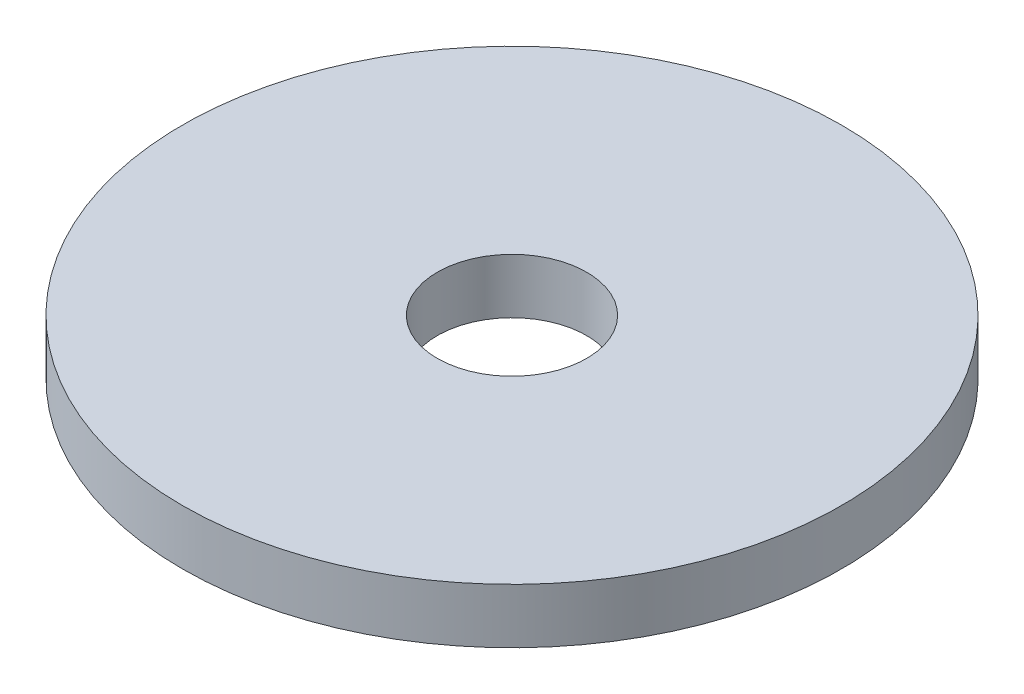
ISO-10303-21;
HEADER;
FILE_DESCRIPTION(('STEP AP214'),'2;1');
FILE_NAME('part.step','',(''),(''),'','','');
FILE_SCHEMA(('AUTOMOTIVE_DESIGN { 1 0 10303 214 1 1 1 1 }'));
ENDSEC;
DATA;
#1=APPLICATION_CONTEXT('core data for automotive mechanical design processes');
#2=APPLICATION_PROTOCOL_DEFINITION('international standard','automotive_design',2000,#1);
#3=PRODUCT_CONTEXT('',#1,'mechanical');
#4=PRODUCT('Part','Part','',(#3));
#5=PRODUCT_RELATED_PRODUCT_CATEGORY('part','',(#4));
#6=PRODUCT_DEFINITION_FORMATION('','',#4);
#7=PRODUCT_DEFINITION_CONTEXT('part definition',#1,'design');
#8=PRODUCT_DEFINITION('design','',#6,#7);
#9=PRODUCT_DEFINITION_SHAPE('','',#8);
#10=(LENGTH_UNIT() NAMED_UNIT(*) SI_UNIT(.MILLI.,.METRE.));
#11=(NAMED_UNIT(*) PLANE_ANGLE_UNIT() SI_UNIT($,.RADIAN.));
#12=(NAMED_UNIT(*) SI_UNIT($,.STERADIAN.) SOLID_ANGLE_UNIT());
#13=UNCERTAINTY_MEASURE_WITH_UNIT(LENGTH_MEASURE(1.E-05),#10,'distance_accuracy_value','');
#14=(GEOMETRIC_REPRESENTATION_CONTEXT(3) GLOBAL_UNCERTAINTY_ASSIGNED_CONTEXT((#13)) GLOBAL_UNIT_ASSIGNED_CONTEXT((#10,
#11,#12)) REPRESENTATION_CONTEXT('',''));
#15=CARTESIAN_POINT('',(0.,0.,0.));
#16=DIRECTION('',(0.,0.,1.));
#17=DIRECTION('',(1.,0.,0.));
#18=AXIS2_PLACEMENT_3D('',#15,#16,#17);
#19=CARTESIAN_POINT('',(1.73472347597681E-13,2.49999999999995,0.));
#20=DIRECTION('',(0.,1.,0.));
#21=DIRECTION('',(0.,0.,1.00000000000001));
#22=AXIS2_PLACEMENT_3D('',#19,#20,#21);
#23=PLANE('',#22);
#24=CARTESIAN_POINT('',(1.73472347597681E-13,2.49999999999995,0.));
#25=DIRECTION('',(0.,1.,0.));
#26=DIRECTION('',(0.,0.,1.00000000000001));
#27=AXIS2_PLACEMENT_3D('',#24,#25,#26);
#28=CIRCLE('',#27,15.);
#29=CARTESIAN_POINT('',(1.73472347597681E-13,2.49999999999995,15.0000000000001));
#30=VERTEX_POINT('',#29);
#31=EDGE_CURVE('E10',#30,#30,#28,.T.);
#32=ORIENTED_EDGE('',*,*,#31,.T.);
#33=EDGE_LOOP('',(#32));
#34=FACE_BOUND('',#33,.T.);
#35=CARTESIAN_POINT('',(1.73472347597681E-13,2.49999999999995,0.));
#36=DIRECTION('',(0.,1.,0.));
#37=DIRECTION('',(0.,0.,1.00000000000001));
#38=AXIS2_PLACEMENT_3D('',#35,#36,#37);
#39=CIRCLE('',#38,3.4);
#40=CARTESIAN_POINT('',(1.73472347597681E-13,2.49999999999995,3.40000000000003));
#41=VERTEX_POINT('',#40);
#42=EDGE_CURVE('E51',#41,#41,#39,.T.);
#43=ORIENTED_EDGE('',*,*,#42,.F.);
#44=EDGE_LOOP('',(#43));
#45=FACE_BOUND('',#44,.T.);
#46=ADVANCED_FACE('F38',(#34,#45),#23,.T.);
#47=CARTESIAN_POINT('',(1.66533453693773E-13,0.,0.));
#48=DIRECTION('',(0.,1.,0.));
#49=DIRECTION('',(0.,0.,1.00000000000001));
#50=AXIS2_PLACEMENT_3D('',#47,#48,#49);
#51=PLANE('',#50);
#52=CARTESIAN_POINT('',(1.66533453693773E-13,0.,0.));
#53=DIRECTION('',(0.,1.,0.));
#54=DIRECTION('',(0.,0.,1.00000000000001));
#55=AXIS2_PLACEMENT_3D('',#52,#53,#54);
#56=CIRCLE('',#55,15.);
#57=CARTESIAN_POINT('',(1.66533453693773E-13,0.,15.0000000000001));
#58=VERTEX_POINT('',#57);
#59=EDGE_CURVE('E46',#58,#58,#56,.T.);
#60=ORIENTED_EDGE('',*,*,#59,.F.);
#61=EDGE_LOOP('',(#60));
#62=FACE_BOUND('',#61,.T.);
#63=CARTESIAN_POINT('',(1.66533453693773E-13,0.,0.));
#64=DIRECTION('',(0.,1.,0.));
#65=DIRECTION('',(0.,0.,1.00000000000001));
#66=AXIS2_PLACEMENT_3D('',#63,#64,#65);
#67=CIRCLE('',#66,3.4);
#68=CARTESIAN_POINT('',(1.66533453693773E-13,0.,3.39999999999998));
#69=VERTEX_POINT('',#68);
#70=EDGE_CURVE('E57',#69,#69,#67,.T.);
#71=ORIENTED_EDGE('',*,*,#70,.T.);
#72=EDGE_LOOP('',(#71));
#73=FACE_BOUND('',#72,.T.);
#74=ADVANCED_FACE('F63',(#62,#73),#51,.F.);
#75=CARTESIAN_POINT('',(1.73472347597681E-13,2.49999999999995,0.));
#76=DIRECTION('',(0.,-1.,0.));
#77=DIRECTION('',(0.,0.,-1.00000000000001));
#78=AXIS2_PLACEMENT_3D('',#75,#76,#77);
#79=CYLINDRICAL_SURFACE('',#78,15.);
#80=ORIENTED_EDGE('',*,*,#31,.F.);
#81=EDGE_LOOP('',(#80));
#82=FACE_BOUND('',#81,.T.);
#83=ORIENTED_EDGE('',*,*,#59,.T.);
#84=EDGE_LOOP('',(#83));
#85=FACE_BOUND('',#84,.T.);
#86=ADVANCED_FACE('F40',(#82,#85),#79,.T.);
#87=CARTESIAN_POINT('',(1.73472347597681E-13,2.49999999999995,0.));
#88=DIRECTION('',(0.,-1.,0.));
#89=DIRECTION('',(0.,0.,-1.00000000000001));
#90=AXIS2_PLACEMENT_3D('',#87,#88,#89);
#91=CYLINDRICAL_SURFACE('',#90,3.4);
#92=ORIENTED_EDGE('',*,*,#42,.T.);
#93=EDGE_LOOP('',(#92));
#94=FACE_BOUND('',#93,.T.);
#95=ORIENTED_EDGE('',*,*,#70,.F.);
#96=EDGE_LOOP('',(#95));
#97=FACE_BOUND('',#96,.T.);
#98=ADVANCED_FACE('F65',(#94,#97),#91,.F.);
#99=CLOSED_SHELL('',(#46,#74,#86,#98));
#100=MANIFOLD_SOLID_BREP('B2',#99);
#101=ADVANCED_BREP_SHAPE_REPRESENTATION('',(#18,#100),#14);
#102=SHAPE_DEFINITION_REPRESENTATION(#9,#101);
ENDSEC;
END-ISO-10303-21;
